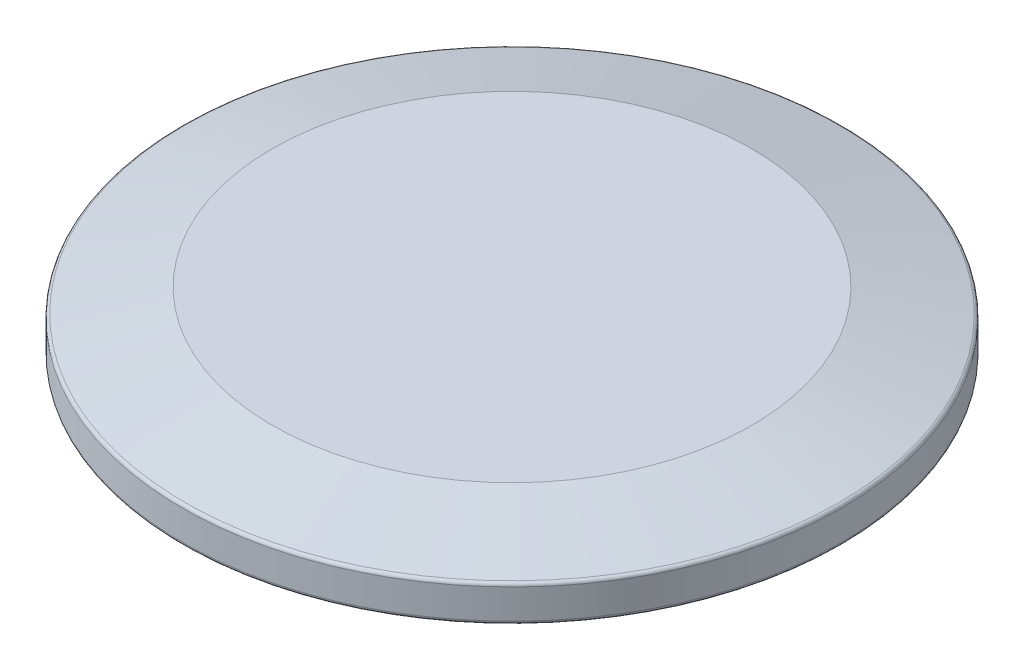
from build123d import *

# Parameters (mm, degrees)
FILLET_1_R = 0.3
FILLET_2_R = 0.3
FILLET_3_R = 0.3


with BuildPart() as part:
    # Sketch 1 → Revolve 1 (revolve)
    with BuildSketch(Plane.XY):
        Polygon((-20.7, 2.5), (-17.5, 2.5), (-17.5, 0), (0, 0), (0, 5), (-20, 5), (-27.5, 3), (-27.5, 0), (-20.7, 0), align=None)
    revolve(axis=Axis((0, 5, 0), (0, -1, 0)))

    # Fillet 1
    fillet_1_edges = [part.edges().sort_by_distance(p)[0] for p in [
        (27.5, 3, 0),
    ]]
    fillet(fillet_1_edges, radius=FILLET_1_R)

    # Fillet 2
    fillet_2_edges = [part.edges().sort_by_distance(p)[0] for p in [
        (27.5, 0, 0),
    ]]
    fillet(fillet_2_edges, radius=FILLET_2_R)

    # Fillet 3
    fillet_3_edges = [part.edges().sort_by_distance(p)[0] for p in [
        (20.7, 0, 0),
    ]]
    fillet(fillet_3_edges, radius=FILLET_3_R)


solid = part.part
